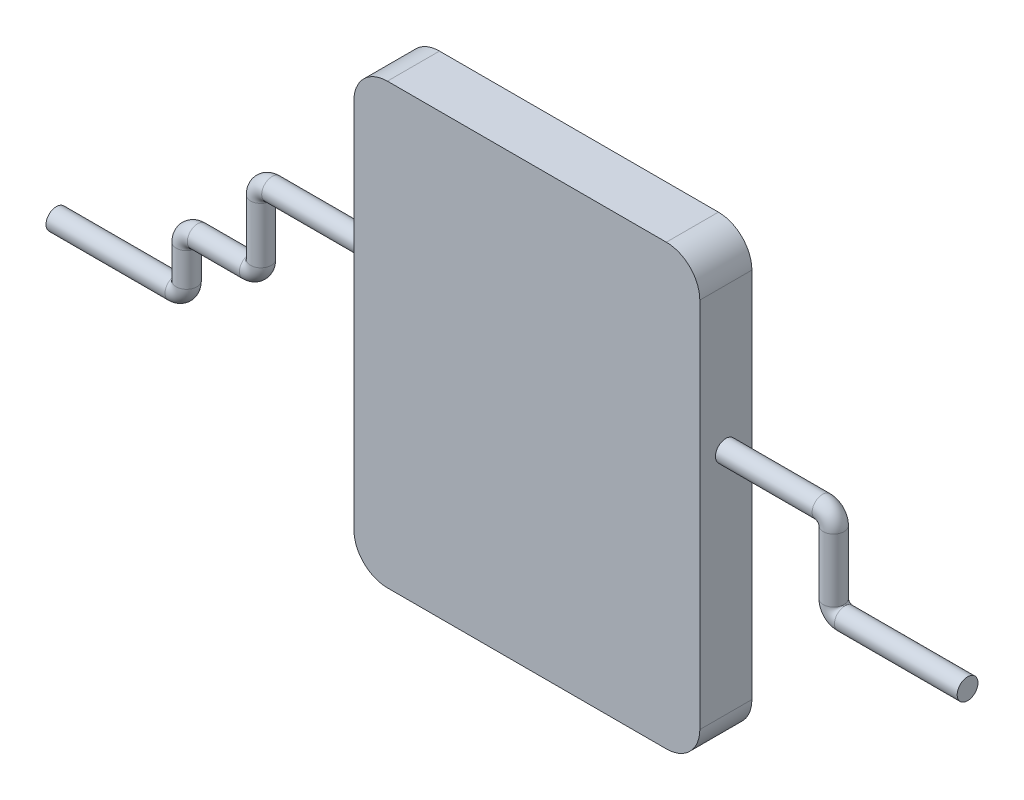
ISO-10303-21;
HEADER;
FILE_DESCRIPTION(('STEP AP214'),'2;1');
FILE_NAME('part.step','',(''),(''),'','','');
FILE_SCHEMA(('AUTOMOTIVE_DESIGN { 1 0 10303 214 1 1 1 1 }'));
ENDSEC;
DATA;
#1=APPLICATION_CONTEXT('core data for automotive mechanical design processes');
#2=APPLICATION_PROTOCOL_DEFINITION('international standard','automotive_design',2000,#1);
#3=PRODUCT_CONTEXT('',#1,'mechanical');
#4=PRODUCT('Part','Part','',(#3));
#5=PRODUCT_RELATED_PRODUCT_CATEGORY('part','',(#4));
#6=PRODUCT_DEFINITION_FORMATION('','',#4);
#7=PRODUCT_DEFINITION_CONTEXT('part definition',#1,'design');
#8=PRODUCT_DEFINITION('design','',#6,#7);
#9=PRODUCT_DEFINITION_SHAPE('','',#8);
#10=(LENGTH_UNIT() NAMED_UNIT(*) SI_UNIT(.MILLI.,.METRE.));
#11=(NAMED_UNIT(*) PLANE_ANGLE_UNIT() SI_UNIT($,.RADIAN.));
#12=(NAMED_UNIT(*) SI_UNIT($,.STERADIAN.) SOLID_ANGLE_UNIT());
#13=UNCERTAINTY_MEASURE_WITH_UNIT(LENGTH_MEASURE(1.E-05),#10,'distance_accuracy_value','');
#14=(GEOMETRIC_REPRESENTATION_CONTEXT(3) GLOBAL_UNCERTAINTY_ASSIGNED_CONTEXT((#13)) GLOBAL_UNIT_ASSIGNED_CONTEXT((#10,
#11,#12)) REPRESENTATION_CONTEXT('',''));
#15=CARTESIAN_POINT('',(0.,0.,0.));
#16=DIRECTION('',(0.,0.,1.));
#17=DIRECTION('',(1.,0.,0.));
#18=AXIS2_PLACEMENT_3D('',#15,#16,#17);
#19=CARTESIAN_POINT('',(-11.811,-14.986,1.778));
#20=DIRECTION('',(1.,0.,0.));
#21=DIRECTION('',(0.,0.,-1.));
#22=AXIS2_PLACEMENT_3D('',#19,#20,#21);
#23=PLANE('',#22);
#24=DIRECTION('',(0.,-1.,0.));
#25=VECTOR('',#24,1.);
#26=CARTESIAN_POINT('',(-11.811,-14.986,-1.778));
#27=LINE('',#26,#25);
#28=CARTESIAN_POINT('',(-11.811,12.7,-1.778));
#29=VERTEX_POINT('',#28);
#30=CARTESIAN_POINT('',(-11.811,-12.7,-1.778));
#31=VERTEX_POINT('',#30);
#32=EDGE_CURVE('E135',#29,#31,#27,.T.);
#33=ORIENTED_EDGE('',*,*,#32,.T.);
#34=DIRECTION('',(0.,0.,-1.));
#35=VECTOR('',#34,1.);
#36=CARTESIAN_POINT('',(-11.811,-12.7,1.778));
#37=LINE('',#36,#35);
#38=CARTESIAN_POINT('',(-11.811,-12.7,1.778));
#39=VERTEX_POINT('',#38);
#40=EDGE_CURVE('E52',#31,#39,#37,.F.);
#41=ORIENTED_EDGE('',*,*,#40,.T.);
#42=DIRECTION('',(0.,-1.,0.));
#43=VECTOR('',#42,1.);
#44=CARTESIAN_POINT('',(-11.811,-14.986,1.778));
#45=LINE('',#44,#43);
#46=CARTESIAN_POINT('',(-11.811,12.7,1.778));
#47=VERTEX_POINT('',#46);
#48=EDGE_CURVE('E189',#47,#39,#45,.T.);
#49=ORIENTED_EDGE('',*,*,#48,.F.);
#50=DIRECTION('',(0.,0.,-1.));
#51=VECTOR('',#50,1.);
#52=CARTESIAN_POINT('',(-11.811,12.7,1.778));
#53=LINE('',#52,#51);
#54=EDGE_CURVE('E162',#47,#29,#53,.T.);
#55=ORIENTED_EDGE('',*,*,#54,.T.);
#56=EDGE_LOOP('',(#33,#41,#49,#55));
#57=FACE_BOUND('',#56,.T.);
#58=CARTESIAN_POINT('',(-11.811,2.92099999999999,0.));
#59=DIRECTION('',(-1.,0.,0.));
#60=DIRECTION('',(0.,0.,1.));
#61=AXIS2_PLACEMENT_3D('',#58,#59,#60);
#62=CIRCLE('',#61,0.7112);
#63=CARTESIAN_POINT('',(-11.811,2.92099999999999,0.7112));
#64=VERTEX_POINT('',#63);
#65=EDGE_CURVE('E11',#64,#64,#62,.T.);
#66=ORIENTED_EDGE('',*,*,#65,.F.);
#67=EDGE_LOOP('',(#66));
#68=FACE_BOUND('',#67,.T.);
#69=ADVANCED_FACE('F35',(#57,#68),#23,.F.);
#70=CARTESIAN_POINT('',(11.811,-14.986,1.778));
#71=DIRECTION('',(-1.,0.,0.));
#72=DIRECTION('',(0.,0.,1.));
#73=AXIS2_PLACEMENT_3D('',#70,#71,#72);
#74=PLANE('',#73);
#75=DIRECTION('',(0.,1.,0.));
#76=VECTOR('',#75,1.);
#77=CARTESIAN_POINT('',(11.811,-14.986,1.778));
#78=LINE('',#77,#76);
#79=CARTESIAN_POINT('',(11.811,-12.7,1.778));
#80=VERTEX_POINT('',#79);
#81=CARTESIAN_POINT('',(11.811,12.7,1.778));
#82=VERTEX_POINT('',#81);
#83=EDGE_CURVE('E125',#80,#82,#78,.T.);
#84=ORIENTED_EDGE('',*,*,#83,.F.);
#85=DIRECTION('',(0.,0.,-1.));
#86=VECTOR('',#85,1.);
#87=CARTESIAN_POINT('',(11.811,-12.7,1.778));
#88=LINE('',#87,#86);
#89=CARTESIAN_POINT('',(11.811,-12.7,-1.778));
#90=VERTEX_POINT('',#89);
#91=EDGE_CURVE('E108',#80,#90,#88,.T.);
#92=ORIENTED_EDGE('',*,*,#91,.T.);
#93=DIRECTION('',(0.,1.,0.));
#94=VECTOR('',#93,1.);
#95=CARTESIAN_POINT('',(11.811,-14.986,-1.778));
#96=LINE('',#95,#94);
#97=CARTESIAN_POINT('',(11.811,12.7,-1.778));
#98=VERTEX_POINT('',#97);
#99=EDGE_CURVE('E122',#90,#98,#96,.T.);
#100=ORIENTED_EDGE('',*,*,#99,.T.);
#101=DIRECTION('',(0.,0.,-1.));
#102=VECTOR('',#101,1.);
#103=CARTESIAN_POINT('',(11.811,12.7,1.778));
#104=LINE('',#103,#102);
#105=EDGE_CURVE('E127',#98,#82,#104,.F.);
#106=ORIENTED_EDGE('',*,*,#105,.T.);
#107=EDGE_LOOP('',(#84,#92,#100,#106));
#108=FACE_BOUND('',#107,.T.);
#109=CARTESIAN_POINT('',(11.811,2.921,0.));
#110=DIRECTION('',(1.,0.,0.));
#111=DIRECTION('',(0.,0.,-1.));
#112=AXIS2_PLACEMENT_3D('',#109,#110,#111);
#113=CIRCLE('',#112,0.7112);
#114=CARTESIAN_POINT('',(11.811,2.921,-0.7112));
#115=VERTEX_POINT('',#114);
#116=EDGE_CURVE('E44',#115,#115,#113,.T.);
#117=ORIENTED_EDGE('',*,*,#116,.F.);
#118=EDGE_LOOP('',(#117));
#119=FACE_BOUND('',#118,.T.);
#120=ADVANCED_FACE('F120',(#108,#119),#74,.F.);
#121=CARTESIAN_POINT('',(-11.811,14.986,1.778));
#122=DIRECTION('',(0.,-1.,0.));
#123=DIRECTION('',(0.,0.,-1.));
#124=AXIS2_PLACEMENT_3D('',#121,#122,#123);
#125=PLANE('',#124);
#126=DIRECTION('',(-1.,0.,0.));
#127=VECTOR('',#126,1.);
#128=CARTESIAN_POINT('',(-11.811,14.986,-1.778));
#129=LINE('',#128,#127);
#130=CARTESIAN_POINT('',(9.525,14.986,-1.778));
#131=VERTEX_POINT('',#130);
#132=CARTESIAN_POINT('',(-9.525,14.986,-1.778));
#133=VERTEX_POINT('',#132);
#134=EDGE_CURVE('E131',#131,#133,#129,.T.);
#135=ORIENTED_EDGE('',*,*,#134,.T.);
#136=DIRECTION('',(0.,0.,-1.));
#137=VECTOR('',#136,1.);
#138=CARTESIAN_POINT('',(-9.525,14.986,1.778));
#139=LINE('',#138,#137);
#140=CARTESIAN_POINT('',(-9.525,14.986,1.778));
#141=VERTEX_POINT('',#140);
#142=EDGE_CURVE('E39',#133,#141,#139,.F.);
#143=ORIENTED_EDGE('',*,*,#142,.T.);
#144=DIRECTION('',(-1.,0.,0.));
#145=VECTOR('',#144,1.);
#146=CARTESIAN_POINT('',(-11.811,14.986,1.778));
#147=LINE('',#146,#145);
#148=CARTESIAN_POINT('',(9.525,14.986,1.778));
#149=VERTEX_POINT('',#148);
#150=EDGE_CURVE('E188',#149,#141,#147,.T.);
#151=ORIENTED_EDGE('',*,*,#150,.F.);
#152=DIRECTION('',(0.,0.,-1.));
#153=VECTOR('',#152,1.);
#154=CARTESIAN_POINT('',(9.525,14.986,1.778));
#155=LINE('',#154,#153);
#156=EDGE_CURVE('E165',#149,#131,#155,.T.);
#157=ORIENTED_EDGE('',*,*,#156,.T.);
#158=EDGE_LOOP('',(#135,#143,#151,#157));
#159=FACE_BOUND('',#158,.T.);
#160=ADVANCED_FACE('F204',(#159),#125,.F.);
#161=CARTESIAN_POINT('',(-11.811,-14.986,1.778));
#162=DIRECTION('',(0.,1.,0.));
#163=DIRECTION('',(0.,0.,1.));
#164=AXIS2_PLACEMENT_3D('',#161,#162,#163);
#165=PLANE('',#164);
#166=DIRECTION('',(1.,0.,0.));
#167=VECTOR('',#166,1.);
#168=CARTESIAN_POINT('',(-11.811,-14.986,-1.778));
#169=LINE('',#168,#167);
#170=CARTESIAN_POINT('',(-9.525,-14.986,-1.778));
#171=VERTEX_POINT('',#170);
#172=CARTESIAN_POINT('',(9.525,-14.986,-1.778));
#173=VERTEX_POINT('',#172);
#174=EDGE_CURVE('E145',#171,#173,#169,.T.);
#175=ORIENTED_EDGE('',*,*,#174,.T.);
#176=DIRECTION('',(0.,0.,-1.));
#177=VECTOR('',#176,1.);
#178=CARTESIAN_POINT('',(9.525,-14.986,1.778));
#179=LINE('',#178,#177);
#180=CARTESIAN_POINT('',(9.525,-14.986,1.778));
#181=VERTEX_POINT('',#180);
#182=EDGE_CURVE('E109',#173,#181,#179,.F.);
#183=ORIENTED_EDGE('',*,*,#182,.T.);
#184=DIRECTION('',(1.,0.,0.));
#185=VECTOR('',#184,1.);
#186=CARTESIAN_POINT('',(-11.811,-14.986,1.778));
#187=LINE('',#186,#185);
#188=CARTESIAN_POINT('',(-9.525,-14.986,1.778));
#189=VERTEX_POINT('',#188);
#190=EDGE_CURVE('E141',#189,#181,#187,.T.);
#191=ORIENTED_EDGE('',*,*,#190,.F.);
#192=DIRECTION('',(0.,0.,-1.));
#193=VECTOR('',#192,1.);
#194=CARTESIAN_POINT('',(-9.525,-14.986,1.778));
#195=LINE('',#194,#193);
#196=EDGE_CURVE('E114',#189,#171,#195,.T.);
#197=ORIENTED_EDGE('',*,*,#196,.T.);
#198=EDGE_LOOP('',(#175,#183,#191,#197));
#199=FACE_BOUND('',#198,.T.);
#200=ADVANCED_FACE('F196',(#199),#165,.F.);
#201=CARTESIAN_POINT('',(0.,0.,1.778));
#202=DIRECTION('',(0.,0.,-1.));
#203=DIRECTION('',(-1.,0.,0.));
#204=AXIS2_PLACEMENT_3D('',#201,#202,#203);
#205=PLANE('',#204);
#206=ORIENTED_EDGE('',*,*,#190,.T.);
#207=CARTESIAN_POINT('',(9.525,-12.7,1.778));
#208=DIRECTION('',(0.,0.,-1.));
#209=DIRECTION('',(-1.,0.,0.));
#210=AXIS2_PLACEMENT_3D('',#207,#208,#209);
#211=CIRCLE('',#210,2.286);
#212=EDGE_CURVE('E160',#181,#80,#211,.F.);
#213=ORIENTED_EDGE('',*,*,#212,.T.);
#214=ORIENTED_EDGE('',*,*,#83,.T.);
#215=CARTESIAN_POINT('',(9.525,12.7,1.778));
#216=DIRECTION('',(0.,0.,-1.));
#217=DIRECTION('',(-1.,0.,0.));
#218=AXIS2_PLACEMENT_3D('',#215,#216,#217);
#219=CIRCLE('',#218,2.286);
#220=EDGE_CURVE('E155',#82,#149,#219,.F.);
#221=ORIENTED_EDGE('',*,*,#220,.T.);
#222=ORIENTED_EDGE('',*,*,#150,.T.);
#223=CARTESIAN_POINT('',(-9.525,12.7,1.778));
#224=DIRECTION('',(0.,0.,-1.));
#225=DIRECTION('',(-1.,0.,0.));
#226=AXIS2_PLACEMENT_3D('',#223,#224,#225);
#227=CIRCLE('',#226,2.286);
#228=EDGE_CURVE('E59',#141,#47,#227,.F.);
#229=ORIENTED_EDGE('',*,*,#228,.T.);
#230=ORIENTED_EDGE('',*,*,#48,.T.);
#231=CARTESIAN_POINT('',(-9.525,-12.7,1.778));
#232=DIRECTION('',(0.,0.,-1.));
#233=DIRECTION('',(-1.,0.,0.));
#234=AXIS2_PLACEMENT_3D('',#231,#232,#233);
#235=CIRCLE('',#234,2.286);
#236=EDGE_CURVE('E158',#39,#189,#235,.F.);
#237=ORIENTED_EDGE('',*,*,#236,.T.);
#238=EDGE_LOOP('',(#206,#213,#214,#221,#222,#229,#230,#237));
#239=FACE_BOUND('',#238,.T.);
#240=ADVANCED_FACE('F193',(#239),#205,.F.);
#241=CARTESIAN_POINT('',(0.,0.,-1.778));
#242=DIRECTION('',(0.,0.,-1.));
#243=DIRECTION('',(-1.,0.,0.));
#244=AXIS2_PLACEMENT_3D('',#241,#242,#243);
#245=PLANE('',#244);
#246=ORIENTED_EDGE('',*,*,#99,.F.);
#247=CARTESIAN_POINT('',(9.525,-12.7,-1.778));
#248=DIRECTION('',(0.,0.,-1.));
#249=DIRECTION('',(-1.,0.,0.));
#250=AXIS2_PLACEMENT_3D('',#247,#248,#249);
#251=CIRCLE('',#250,2.286);
#252=EDGE_CURVE('E104',#90,#173,#251,.T.);
#253=ORIENTED_EDGE('',*,*,#252,.T.);
#254=ORIENTED_EDGE('',*,*,#174,.F.);
#255=CARTESIAN_POINT('',(-9.525,-12.7,-1.778));
#256=DIRECTION('',(0.,0.,-1.));
#257=DIRECTION('',(-1.,0.,0.));
#258=AXIS2_PLACEMENT_3D('',#255,#256,#257);
#259=CIRCLE('',#258,2.286);
#260=EDGE_CURVE('E115',#171,#31,#259,.T.);
#261=ORIENTED_EDGE('',*,*,#260,.T.);
#262=ORIENTED_EDGE('',*,*,#32,.F.);
#263=CARTESIAN_POINT('',(-9.525,12.7,-1.778));
#264=DIRECTION('',(0.,0.,-1.));
#265=DIRECTION('',(-1.,0.,0.));
#266=AXIS2_PLACEMENT_3D('',#263,#264,#265);
#267=CIRCLE('',#266,2.286);
#268=EDGE_CURVE('E149',#29,#133,#267,.T.);
#269=ORIENTED_EDGE('',*,*,#268,.T.);
#270=ORIENTED_EDGE('',*,*,#134,.F.);
#271=CARTESIAN_POINT('',(9.525,12.7,-1.778));
#272=DIRECTION('',(0.,0.,-1.));
#273=DIRECTION('',(-1.,0.,0.));
#274=AXIS2_PLACEMENT_3D('',#271,#272,#273);
#275=CIRCLE('',#274,2.286);
#276=EDGE_CURVE('E126',#131,#98,#275,.T.);
#277=ORIENTED_EDGE('',*,*,#276,.T.);
#278=EDGE_LOOP('',(#246,#253,#254,#261,#262,#269,#270,#277));
#279=FACE_BOUND('',#278,.T.);
#280=ADVANCED_FACE('F129',(#279),#245,.T.);
#281=CARTESIAN_POINT('',(9.525,-12.7,1.778));
#282=DIRECTION('',(0.,0.,-1.));
#283=DIRECTION('',(-1.,0.,0.));
#284=AXIS2_PLACEMENT_3D('',#281,#282,#283);
#285=CYLINDRICAL_SURFACE('',#284,2.286);
#286=ORIENTED_EDGE('',*,*,#212,.F.);
#287=ORIENTED_EDGE('',*,*,#182,.F.);
#288=ORIENTED_EDGE('',*,*,#252,.F.);
#289=ORIENTED_EDGE('',*,*,#91,.F.);
#290=EDGE_LOOP('',(#286,#287,#288,#289));
#291=FACE_BOUND('',#290,.T.);
#292=ADVANCED_FACE('F107',(#291),#285,.T.);
#293=CARTESIAN_POINT('',(-9.525,-12.7,1.778));
#294=DIRECTION('',(0.,0.,-1.));
#295=DIRECTION('',(-1.,0.,0.));
#296=AXIS2_PLACEMENT_3D('',#293,#294,#295);
#297=CYLINDRICAL_SURFACE('',#296,2.286);
#298=ORIENTED_EDGE('',*,*,#236,.F.);
#299=ORIENTED_EDGE('',*,*,#40,.F.);
#300=ORIENTED_EDGE('',*,*,#260,.F.);
#301=ORIENTED_EDGE('',*,*,#196,.F.);
#302=EDGE_LOOP('',(#298,#299,#300,#301));
#303=FACE_BOUND('',#302,.T.);
#304=ADVANCED_FACE('F198',(#303),#297,.T.);
#305=CARTESIAN_POINT('',(-9.525,12.7,1.778));
#306=DIRECTION('',(0.,0.,-1.));
#307=DIRECTION('',(-1.,0.,0.));
#308=AXIS2_PLACEMENT_3D('',#305,#306,#307);
#309=CYLINDRICAL_SURFACE('',#308,2.286);
#310=ORIENTED_EDGE('',*,*,#228,.F.);
#311=ORIENTED_EDGE('',*,*,#142,.F.);
#312=ORIENTED_EDGE('',*,*,#268,.F.);
#313=ORIENTED_EDGE('',*,*,#54,.F.);
#314=EDGE_LOOP('',(#310,#311,#312,#313));
#315=FACE_BOUND('',#314,.T.);
#316=ADVANCED_FACE('F203',(#315),#309,.T.);
#317=CARTESIAN_POINT('',(9.525,12.7,1.778));
#318=DIRECTION('',(0.,0.,-1.));
#319=DIRECTION('',(-1.,0.,0.));
#320=AXIS2_PLACEMENT_3D('',#317,#318,#319);
#321=CYLINDRICAL_SURFACE('',#320,2.286);
#322=ORIENTED_EDGE('',*,*,#220,.F.);
#323=ORIENTED_EDGE('',*,*,#105,.F.);
#324=ORIENTED_EDGE('',*,*,#276,.F.);
#325=ORIENTED_EDGE('',*,*,#156,.F.);
#326=EDGE_LOOP('',(#322,#323,#324,#325));
#327=FACE_BOUND('',#326,.T.);
#328=ADVANCED_FACE('F37',(#327),#321,.T.);
#329=CARTESIAN_POINT('',(19.939,-2.921,0.));
#330=DIRECTION('',(1.,0.,0.));
#331=DIRECTION('',(0.,1.,0.));
#332=AXIS2_PLACEMENT_3D('',#329,#330,#331);
#333=CYLINDRICAL_SURFACE('',#332,0.7112);
#334=CARTESIAN_POINT('',(19.939,-2.921,0.));
#335=DIRECTION('',(1.,0.,0.));
#336=DIRECTION('',(0.,0.,-1.));
#337=AXIS2_PLACEMENT_3D('',#334,#335,#336);
#338=CIRCLE('',#337,0.7112);
#339=CARTESIAN_POINT('',(19.939,-3.6322,0.));
#340=VERTEX_POINT('',#339);
#341=EDGE_CURVE('E138',#340,#340,#338,.T.);
#342=ORIENTED_EDGE('',*,*,#341,.T.);
#343=EDGE_LOOP('',(#342));
#344=FACE_BOUND('',#343,.T.);
#345=CARTESIAN_POINT('',(28.321,-2.921,0.));
#346=DIRECTION('',(1.,0.,0.));
#347=DIRECTION('',(0.,0.,-1.));
#348=AXIS2_PLACEMENT_3D('',#345,#346,#347);
#349=CIRCLE('',#348,0.7112);
#350=CARTESIAN_POINT('',(28.321,-2.921,-0.7112));
#351=VERTEX_POINT('',#350);
#352=EDGE_CURVE('E132',#351,#351,#349,.T.);
#353=ORIENTED_EDGE('',*,*,#352,.F.);
#354=EDGE_LOOP('',(#353));
#355=FACE_BOUND('',#354,.T.);
#356=ADVANCED_FACE('F222',(#344,#355),#333,.T.);
#357=CARTESIAN_POINT('',(19.939,-2.159,0.));
#358=DIRECTION('',(0.,0.,1.));
#359=DIRECTION('',(1.,0.,0.));
#360=AXIS2_PLACEMENT_3D('',#357,#358,#359);
#361=TOROIDAL_SURFACE('',#360,0.761999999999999,0.7112);
#362=CARTESIAN_POINT('',(19.177,-2.159,0.));
#363=DIRECTION('',(0.,-1.,0.));
#364=DIRECTION('',(0.,0.,-1.));
#365=AXIS2_PLACEMENT_3D('',#362,#363,#364);
#366=CIRCLE('',#365,0.7112);
#367=CARTESIAN_POINT('',(18.4658,-2.159,0.));
#368=VERTEX_POINT('',#367);
#369=EDGE_CURVE('E182',#368,#368,#366,.T.);
#370=CARTESIAN_POINT('',(19.939,-2.159,0.));
#371=DIRECTION('',(0.,0.,1.));
#372=DIRECTION('',(1.,0.,0.));
#373=AXIS2_PLACEMENT_3D('',#370,#371,#372);
#374=CIRCLE('',#373,1.4732);
#375=EDGE_CURVE('',#368,#340,#374,.T.);
#376=ORIENTED_EDGE('',*,*,#369,.T.);
#377=ORIENTED_EDGE('',*,*,#341,.F.);
#378=ORIENTED_EDGE('',*,*,#375,.T.);
#379=ORIENTED_EDGE('',*,*,#375,.F.);
#380=EDGE_LOOP('',(#376,#378,#377,#379));
#381=FACE_BOUND('',#380,.T.);
#382=ADVANCED_FACE('F225',(#381),#361,.T.);
#383=CARTESIAN_POINT('',(19.177,2.159,0.));
#384=DIRECTION('',(0.,-1.,0.));
#385=DIRECTION('',(0.,0.,-1.));
#386=AXIS2_PLACEMENT_3D('',#383,#384,#385);
#387=CYLINDRICAL_SURFACE('',#386,0.7112);
#388=CARTESIAN_POINT('',(19.177,2.159,0.));
#389=DIRECTION('',(0.,-1.,0.));
#390=DIRECTION('',(0.,0.,-1.));
#391=AXIS2_PLACEMENT_3D('',#388,#389,#390);
#392=CIRCLE('',#391,0.7112);
#393=CARTESIAN_POINT('',(19.8882,2.159,0.));
#394=VERTEX_POINT('',#393);
#395=EDGE_CURVE('E179',#394,#394,#392,.T.);
#396=ORIENTED_EDGE('',*,*,#395,.T.);
#397=EDGE_LOOP('',(#396));
#398=FACE_BOUND('',#397,.T.);
#399=ORIENTED_EDGE('',*,*,#369,.F.);
#400=EDGE_LOOP('',(#399));
#401=FACE_BOUND('',#400,.T.);
#402=ADVANCED_FACE('F229',(#398,#401),#387,.T.);
#403=CARTESIAN_POINT('',(18.415,2.159,0.));
#404=DIRECTION('',(0.,0.,-1.));
#405=DIRECTION('',(-1.,0.,0.));
#406=AXIS2_PLACEMENT_3D('',#403,#404,#405);
#407=TOROIDAL_SURFACE('',#406,0.762,0.7112);
#408=CARTESIAN_POINT('',(18.415,2.921,0.));
#409=DIRECTION('',(1.,0.,0.));
#410=DIRECTION('',(0.,0.,-1.));
#411=AXIS2_PLACEMENT_3D('',#408,#409,#410);
#412=CIRCLE('',#411,0.7112);
#413=CARTESIAN_POINT('',(18.415,3.6322,0.));
#414=VERTEX_POINT('',#413);
#415=EDGE_CURVE('E177',#414,#414,#412,.T.);
#416=CARTESIAN_POINT('',(18.415,2.159,0.));
#417=DIRECTION('',(0.,0.,-1.));
#418=DIRECTION('',(-1.,0.,0.));
#419=AXIS2_PLACEMENT_3D('',#416,#417,#418);
#420=CIRCLE('',#419,1.4732);
#421=EDGE_CURVE('',#414,#394,#420,.T.);
#422=ORIENTED_EDGE('',*,*,#415,.T.);
#423=ORIENTED_EDGE('',*,*,#395,.F.);
#424=ORIENTED_EDGE('',*,*,#421,.T.);
#425=ORIENTED_EDGE('',*,*,#421,.F.);
#426=EDGE_LOOP('',(#422,#424,#423,#425));
#427=FACE_BOUND('',#426,.T.);
#428=ADVANCED_FACE('F233',(#427),#407,.T.);
#429=CARTESIAN_POINT('',(18.415,2.921,0.));
#430=DIRECTION('',(-1.,0.,0.));
#431=DIRECTION('',(0.,0.,1.));
#432=AXIS2_PLACEMENT_3D('',#429,#430,#431);
#433=CYLINDRICAL_SURFACE('',#432,0.7112);
#434=ORIENTED_EDGE('',*,*,#415,.F.);
#435=EDGE_LOOP('',(#434));
#436=FACE_BOUND('',#435,.T.);
#437=ORIENTED_EDGE('',*,*,#116,.T.);
#438=EDGE_LOOP('',(#437));
#439=FACE_BOUND('',#438,.T.);
#440=ADVANCED_FACE('F237',(#436,#439),#433,.T.);
#441=CARTESIAN_POINT('',(28.321,-2.921,0.));
#442=DIRECTION('',(1.,0.,0.));
#443=DIRECTION('',(0.,0.,-1.));
#444=AXIS2_PLACEMENT_3D('',#441,#442,#443);
#445=PLANE('',#444);
#446=ORIENTED_EDGE('',*,*,#352,.T.);
#447=EDGE_LOOP('',(#446));
#448=FACE_BOUND('',#447,.T.);
#449=ADVANCED_FACE('F241',(#448),#445,.T.);
#450=CARTESIAN_POINT('',(-25.781,-6.223,0.));
#451=DIRECTION('',(-1.,0.,0.));
#452=DIRECTION('',(0.,-1.,0.));
#453=AXIS2_PLACEMENT_3D('',#450,#451,#452);
#454=CYLINDRICAL_SURFACE('',#453,0.7112);
#455=CARTESIAN_POINT('',(-25.781,-6.223,0.));
#456=DIRECTION('',(-1.,0.,0.));
#457=DIRECTION('',(0.,0.,1.));
#458=AXIS2_PLACEMENT_3D('',#455,#456,#457);
#459=CIRCLE('',#458,0.7112);
#460=CARTESIAN_POINT('',(-25.781,-6.9342,0.));
#461=VERTEX_POINT('',#460);
#462=EDGE_CURVE('E291',#461,#461,#459,.T.);
#463=ORIENTED_EDGE('',*,*,#462,.T.);
#464=EDGE_LOOP('',(#463));
#465=FACE_BOUND('',#464,.T.);
#466=CARTESIAN_POINT('',(-33.909,-6.223,0.));
#467=DIRECTION('',(-1.,0.,0.));
#468=DIRECTION('',(0.,0.,1.));
#469=AXIS2_PLACEMENT_3D('',#466,#467,#468);
#470=CIRCLE('',#469,0.7112);
#471=CARTESIAN_POINT('',(-33.909,-6.223,0.7112));
#472=VERTEX_POINT('',#471);
#473=EDGE_CURVE('E289',#472,#472,#470,.T.);
#474=ORIENTED_EDGE('',*,*,#473,.F.);
#475=EDGE_LOOP('',(#474));
#476=FACE_BOUND('',#475,.T.);
#477=ADVANCED_FACE('F245',(#465,#476),#454,.T.);
#478=CARTESIAN_POINT('',(-25.781,-5.46100000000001,0.));
#479=DIRECTION('',(0.,0.,-1.));
#480=DIRECTION('',(-1.,0.,0.));
#481=AXIS2_PLACEMENT_3D('',#478,#479,#480);
#482=TOROIDAL_SURFACE('',#481,0.761999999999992,0.7112);
#483=CARTESIAN_POINT('',(-25.019,-5.461,0.));
#484=DIRECTION('',(0.,-1.,0.));
#485=DIRECTION('',(0.,0.,1.));
#486=AXIS2_PLACEMENT_3D('',#483,#484,#485);
#487=CIRCLE('',#486,0.7112);
#488=CARTESIAN_POINT('',(-24.3078,-5.46099999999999,0.));
#489=VERTEX_POINT('',#488);
#490=EDGE_CURVE('E294',#489,#489,#487,.T.);
#491=CARTESIAN_POINT('',(-25.781,-5.46100000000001,0.));
#492=DIRECTION('',(0.,0.,-1.));
#493=DIRECTION('',(-1.,0.,0.));
#494=AXIS2_PLACEMENT_3D('',#491,#492,#493);
#495=CIRCLE('',#494,1.47319999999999);
#496=EDGE_CURVE('',#489,#461,#495,.T.);
#497=ORIENTED_EDGE('',*,*,#490,.T.);
#498=ORIENTED_EDGE('',*,*,#462,.F.);
#499=ORIENTED_EDGE('',*,*,#496,.T.);
#500=ORIENTED_EDGE('',*,*,#496,.F.);
#501=EDGE_LOOP('',(#497,#499,#498,#500));
#502=FACE_BOUND('',#501,.T.);
#503=ADVANCED_FACE('F249',(#502),#482,.T.);
#504=CARTESIAN_POINT('',(-25.019,-3.17500000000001,0.));
#505=DIRECTION('',(0.,-1.,0.));
#506=DIRECTION('',(0.,0.,-1.));
#507=AXIS2_PLACEMENT_3D('',#504,#505,#506);
#508=CYLINDRICAL_SURFACE('',#507,0.7112);
#509=CARTESIAN_POINT('',(-25.019,-3.17500000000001,0.));
#510=DIRECTION('',(0.,-1.,0.));
#511=DIRECTION('',(0.,0.,1.));
#512=AXIS2_PLACEMENT_3D('',#509,#510,#511);
#513=CIRCLE('',#512,0.7112);
#514=CARTESIAN_POINT('',(-25.7302,-3.17500000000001,0.));
#515=VERTEX_POINT('',#514);
#516=EDGE_CURVE('E299',#515,#515,#513,.T.);
#517=ORIENTED_EDGE('',*,*,#516,.T.);
#518=EDGE_LOOP('',(#517));
#519=FACE_BOUND('',#518,.T.);
#520=ORIENTED_EDGE('',*,*,#490,.F.);
#521=EDGE_LOOP('',(#520));
#522=FACE_BOUND('',#521,.T.);
#523=ADVANCED_FACE('F253',(#519,#522),#508,.T.);
#524=CARTESIAN_POINT('',(-24.257,-3.17500000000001,0.));
#525=DIRECTION('',(0.,0.,1.));
#526=DIRECTION('',(1.,0.,0.));
#527=AXIS2_PLACEMENT_3D('',#524,#525,#526);
#528=TOROIDAL_SURFACE('',#527,0.762000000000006,0.7112);
#529=CARTESIAN_POINT('',(-24.257,-2.413,0.));
#530=DIRECTION('',(-1.,0.,0.));
#531=DIRECTION('',(0.,0.,1.));
#532=AXIS2_PLACEMENT_3D('',#529,#530,#531);
#533=CIRCLE('',#532,0.7112);
#534=CARTESIAN_POINT('',(-24.257,-1.7018,0.));
#535=VERTEX_POINT('',#534);
#536=EDGE_CURVE('E302',#535,#535,#533,.T.);
#537=CARTESIAN_POINT('',(-24.257,-3.17500000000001,0.));
#538=DIRECTION('',(0.,0.,1.));
#539=DIRECTION('',(1.,0.,0.));
#540=AXIS2_PLACEMENT_3D('',#537,#538,#539);
#541=CIRCLE('',#540,1.47320000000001);
#542=EDGE_CURVE('',#535,#515,#541,.T.);
#543=ORIENTED_EDGE('',*,*,#536,.T.);
#544=ORIENTED_EDGE('',*,*,#516,.F.);
#545=ORIENTED_EDGE('',*,*,#542,.T.);
#546=ORIENTED_EDGE('',*,*,#542,.F.);
#547=EDGE_LOOP('',(#543,#545,#544,#546));
#548=FACE_BOUND('',#547,.T.);
#549=ADVANCED_FACE('F257',(#548),#528,.T.);
#550=CARTESIAN_POINT('',(-20.701,-2.413,0.));
#551=DIRECTION('',(-1.,0.,0.));
#552=DIRECTION('',(0.,-1.,0.));
#553=AXIS2_PLACEMENT_3D('',#550,#551,#552);
#554=CYLINDRICAL_SURFACE('',#553,0.7112);
#555=CARTESIAN_POINT('',(-20.701,-2.413,0.));
#556=DIRECTION('',(-1.,0.,0.));
#557=DIRECTION('',(0.,0.,1.));
#558=AXIS2_PLACEMENT_3D('',#555,#556,#557);
#559=CIRCLE('',#558,0.7112);
#560=CARTESIAN_POINT('',(-20.701,-3.1242,0.));
#561=VERTEX_POINT('',#560);
#562=EDGE_CURVE('E305',#561,#561,#559,.T.);
#563=ORIENTED_EDGE('',*,*,#562,.T.);
#564=EDGE_LOOP('',(#563));
#565=FACE_BOUND('',#564,.T.);
#566=ORIENTED_EDGE('',*,*,#536,.F.);
#567=EDGE_LOOP('',(#566));
#568=FACE_BOUND('',#567,.T.);
#569=ADVANCED_FACE('F261',(#565,#568),#554,.T.);
#570=CARTESIAN_POINT('',(-20.701,-1.65100000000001,0.));
#571=DIRECTION('',(0.,0.,-1.));
#572=DIRECTION('',(-1.,0.,0.));
#573=AXIS2_PLACEMENT_3D('',#570,#571,#572);
#574=TOROIDAL_SURFACE('',#573,0.761999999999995,0.7112);
#575=CARTESIAN_POINT('',(-19.939,-1.651,0.));
#576=DIRECTION('',(0.,-1.,0.));
#577=DIRECTION('',(0.,0.,1.));
#578=AXIS2_PLACEMENT_3D('',#575,#576,#577);
#579=CIRCLE('',#578,0.7112);
#580=CARTESIAN_POINT('',(-19.2278,-1.65099999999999,0.));
#581=VERTEX_POINT('',#580);
#582=EDGE_CURVE('E308',#581,#581,#579,.T.);
#583=CARTESIAN_POINT('',(-20.701,-1.65100000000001,0.));
#584=DIRECTION('',(0.,0.,-1.));
#585=DIRECTION('',(-1.,0.,0.));
#586=AXIS2_PLACEMENT_3D('',#583,#584,#585);
#587=CIRCLE('',#586,1.4732);
#588=EDGE_CURVE('',#581,#561,#587,.T.);
#589=ORIENTED_EDGE('',*,*,#582,.T.);
#590=ORIENTED_EDGE('',*,*,#562,.F.);
#591=ORIENTED_EDGE('',*,*,#588,.T.);
#592=ORIENTED_EDGE('',*,*,#588,.F.);
#593=EDGE_LOOP('',(#589,#591,#590,#592));
#594=FACE_BOUND('',#593,.T.);
#595=ADVANCED_FACE('F265',(#594),#574,.T.);
#596=CARTESIAN_POINT('',(-19.939,2.15899999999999,0.));
#597=DIRECTION('',(0.,-1.,0.));
#598=DIRECTION('',(0.,0.,-1.));
#599=AXIS2_PLACEMENT_3D('',#596,#597,#598);
#600=CYLINDRICAL_SURFACE('',#599,0.7112);
#601=CARTESIAN_POINT('',(-19.939,2.15899999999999,0.));
#602=DIRECTION('',(0.,-1.,0.));
#603=DIRECTION('',(0.,0.,1.));
#604=AXIS2_PLACEMENT_3D('',#601,#602,#603);
#605=CIRCLE('',#604,0.7112);
#606=CARTESIAN_POINT('',(-20.6502,2.15899999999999,0.));
#607=VERTEX_POINT('',#606);
#608=EDGE_CURVE('E311',#607,#607,#605,.T.);
#609=ORIENTED_EDGE('',*,*,#608,.T.);
#610=EDGE_LOOP('',(#609));
#611=FACE_BOUND('',#610,.T.);
#612=ORIENTED_EDGE('',*,*,#582,.F.);
#613=EDGE_LOOP('',(#612));
#614=FACE_BOUND('',#613,.T.);
#615=ADVANCED_FACE('F269',(#611,#614),#600,.T.);
#616=CARTESIAN_POINT('',(-19.177,2.15899999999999,0.));
#617=DIRECTION('',(0.,0.,1.));
#618=DIRECTION('',(1.,0.,0.));
#619=AXIS2_PLACEMENT_3D('',#616,#617,#618);
#620=TOROIDAL_SURFACE('',#619,0.762,0.7112);
#621=CARTESIAN_POINT('',(-19.177,2.92099999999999,0.));
#622=DIRECTION('',(-1.,0.,0.));
#623=DIRECTION('',(0.,0.,1.));
#624=AXIS2_PLACEMENT_3D('',#621,#622,#623);
#625=CIRCLE('',#624,0.7112);
#626=CARTESIAN_POINT('',(-19.177,3.63219999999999,0.));
#627=VERTEX_POINT('',#626);
#628=EDGE_CURVE('E313',#627,#627,#625,.T.);
#629=CARTESIAN_POINT('',(-19.177,2.15899999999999,0.));
#630=DIRECTION('',(0.,0.,1.));
#631=DIRECTION('',(1.,0.,0.));
#632=AXIS2_PLACEMENT_3D('',#629,#630,#631);
#633=CIRCLE('',#632,1.4732);
#634=EDGE_CURVE('',#627,#607,#633,.T.);
#635=ORIENTED_EDGE('',*,*,#628,.T.);
#636=ORIENTED_EDGE('',*,*,#608,.F.);
#637=ORIENTED_EDGE('',*,*,#634,.T.);
#638=ORIENTED_EDGE('',*,*,#634,.F.);
#639=EDGE_LOOP('',(#635,#637,#636,#638));
#640=FACE_BOUND('',#639,.T.);
#641=ADVANCED_FACE('F273',(#640),#620,.T.);
#642=CARTESIAN_POINT('',(-19.177,2.92099999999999,0.));
#643=DIRECTION('',(1.,0.,0.));
#644=DIRECTION('',(0.,0.,-1.));
#645=AXIS2_PLACEMENT_3D('',#642,#643,#644);
#646=CYLINDRICAL_SURFACE('',#645,0.7112);
#647=ORIENTED_EDGE('',*,*,#628,.F.);
#648=EDGE_LOOP('',(#647));
#649=FACE_BOUND('',#648,.T.);
#650=ORIENTED_EDGE('',*,*,#65,.T.);
#651=EDGE_LOOP('',(#650));
#652=FACE_BOUND('',#651,.T.);
#653=ADVANCED_FACE('F277',(#649,#652),#646,.T.);
#654=CARTESIAN_POINT('',(-33.909,-6.223,0.));
#655=DIRECTION('',(-1.,0.,0.));
#656=DIRECTION('',(0.,0.,1.));
#657=AXIS2_PLACEMENT_3D('',#654,#655,#656);
#658=PLANE('',#657);
#659=ORIENTED_EDGE('',*,*,#473,.T.);
#660=EDGE_LOOP('',(#659));
#661=FACE_BOUND('',#660,.T.);
#662=ADVANCED_FACE('F281',(#661),#658,.T.);
#663=CLOSED_SHELL('',(#69,#120,#160,#200,#240,#280,#292,#304,#316,#328,#356,#382,#402,#428,#440,
#449,#477,#503,#523,#549,#569,#595,#615,#641,#653,#662));
#664=MANIFOLD_SOLID_BREP('B2',#663);
#665=ADVANCED_BREP_SHAPE_REPRESENTATION('',(#18,#664),#14);
#666=SHAPE_DEFINITION_REPRESENTATION(#9,#665);
ENDSEC;
END-ISO-10303-21;
